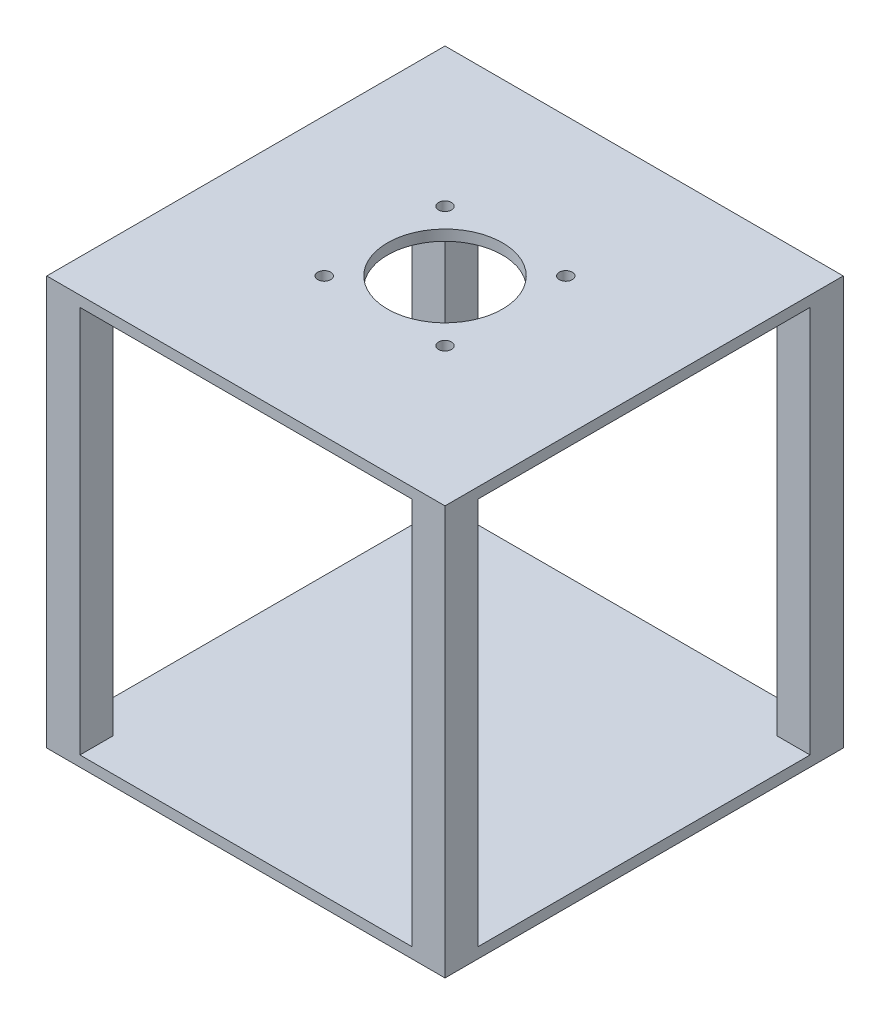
from build123d import *

# Parameters (mm, degrees)
SKETCH1_W           = 76.2
SKETCH1_H           = 76.2
BOSS_EXTRUDE1_DEPTH = 2.032
SKETCH2_R           = 10.9982
CUT_EXTRUDE1_DEPTH  = 108.78222963
SKETCH3_W           = 6.35
SKETCH3_H           = 6.35
BOSS_EXTRUDE2_DEPTH = 76.2
BOSS_EXTRUDE3_DEPTH = 2.032
CUT_EXTRUDE2_REACH  = 135.166
SKETCH5_R           = 1.24968


with BuildPart() as part:
    # Sketch1 → Boss-Extrude1 (new body)
    with BuildSketch(Plane(origin=(0, 0, 0), x_dir=(1, 0, 0), z_dir=(0, 1, 0))):
        with Locations((38.1, 38.1)):
            Rectangle(SKETCH1_W, SKETCH1_H)
    extrude(amount=BOSS_EXTRUDE1_DEPTH)

    # Sketch2 → Cut-Extrude1 (cut, through all)
    with BuildSketch(Plane(origin=(0, 2.032, 0), x_dir=(1, 0, 0), z_dir=(0, 1, 0))):
        with Locations(Location((38.1, 38.1, 0), (0, 0, 270))):
            Circle(SKETCH2_R)
    extrude(amount=-CUT_EXTRUDE1_DEPTH, mode=Mode.SUBTRACT)

    # Sketch3 → Boss-Extrude2 (add)
    with BuildSketch(Plane.XZ):
        with Locations((3.175, -3.175)):
            Rectangle(SKETCH3_W, SKETCH3_H)
        with Locations((3.175, -73.025)):
            Rectangle(SKETCH3_W, SKETCH3_H)
        with Locations((73.025, -73.025)):
            Rectangle(SKETCH3_W, SKETCH3_H)
        with Locations((73.025, -3.175)):
            Rectangle(SKETCH3_W, SKETCH3_H)
    extrude(amount=BOSS_EXTRUDE2_DEPTH)

    # Sketch4 → Boss-Extrude3 (add)
    with BuildSketch(Plane.XZ.offset(76.2)):
        Polygon((76.2, -6.35), (69.85, -6.35), (69.85, 0), (6.35, 0), (6.35, -6.35), (0, -6.35), (0, -69.85), (6.35, -69.85), (6.35, -76.2), (69.85, -76.2), (69.85, -69.85), (76.2, -69.85), align=None)
    extrude(amount=-BOSS_EXTRUDE3_DEPTH)

    # Sketch5 → Cut-Extrude2 (cut, up to next)
    with BuildSketch(Plane(origin=(0, 2.032, 0), x_dir=(1, 0, 0), z_dir=(0, 1, 0)), mode=Mode.PRIVATE) as cut_extrude2_sk1:
        with Locations(Location((26.543, 26.543, 0), (0, 0, 270))):
            Circle(SKETCH5_R)
    cut_extrude2_tool1 = extrude(cut_extrude2_sk1.sketch, amount=-CUT_EXTRUDE2_REACH, mode=Mode.PRIVATE) & part.part
    # Sketch5 → Cut-Extrude2 (cut, up to next)
    with BuildSketch(Plane(origin=(0, 2.032, 0), x_dir=(1, 0, 0), z_dir=(0, 1, 0)), mode=Mode.PRIVATE) as cut_extrude2_sk2:
        with Locations(Location((26.543, 49.657, 0), (0, 0, 270))):
            Circle(SKETCH5_R)
    cut_extrude2_tool2 = extrude(cut_extrude2_sk2.sketch, amount=-CUT_EXTRUDE2_REACH, mode=Mode.PRIVATE) & part.part
    # Sketch5 → Cut-Extrude2 (cut, up to next)
    with BuildSketch(Plane(origin=(0, 2.032, 0), x_dir=(1, 0, 0), z_dir=(0, 1, 0)), mode=Mode.PRIVATE) as cut_extrude2_sk3:
        with Locations(Location((49.657, 49.657, 0), (0, 0, 270))):
            Circle(SKETCH5_R)
    cut_extrude2_tool3 = extrude(cut_extrude2_sk3.sketch, amount=-CUT_EXTRUDE2_REACH, mode=Mode.PRIVATE) & part.part
    # Sketch5 → Cut-Extrude2 (cut, up to next)
    with BuildSketch(Plane(origin=(0, 2.032, 0), x_dir=(1, 0, 0), z_dir=(0, 1, 0)), mode=Mode.PRIVATE) as cut_extrude2_sk4:
        with Locations(Location((49.657, 26.543, 0), (0, 0, 270))):
            Circle(SKETCH5_R)
    cut_extrude2_tool4 = extrude(cut_extrude2_sk4.sketch, amount=-CUT_EXTRUDE2_REACH, mode=Mode.PRIVATE) & part.part
    add(cut_extrude2_tool1.solids().sort_by_distance((26.543, 2.032, -26.543))[0], mode=Mode.SUBTRACT)
    add(cut_extrude2_tool2.solids().sort_by_distance((26.543, 2.032, -49.657))[0], mode=Mode.SUBTRACT)
    add(cut_extrude2_tool3.solids().sort_by_distance((49.657, 2.032, -49.657))[0], mode=Mode.SUBTRACT)
    add(cut_extrude2_tool4.solids().sort_by_distance((49.657, 2.032, -26.543))[0], mode=Mode.SUBTRACT)


solid = part.part
